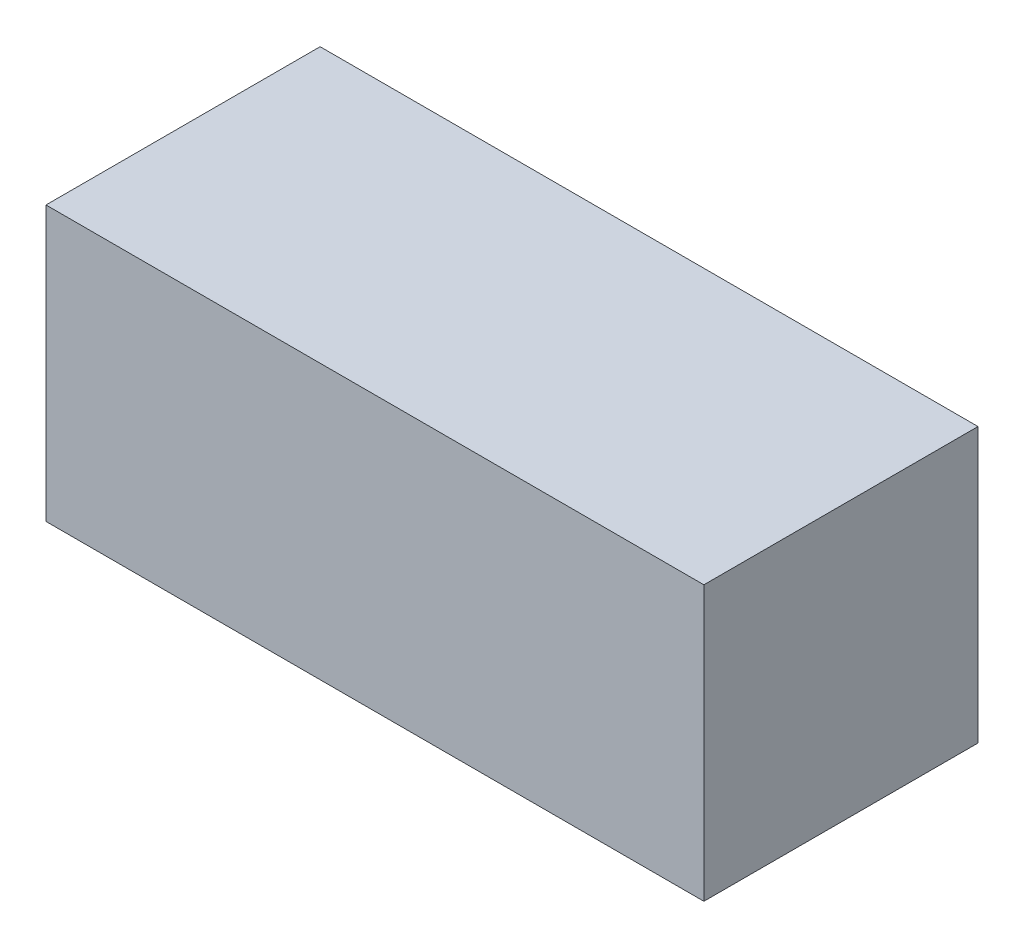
ISO-10303-21;
HEADER;
FILE_DESCRIPTION(('STEP AP214'),'2;1');
FILE_NAME('part.step','',(''),(''),'','','');
FILE_SCHEMA(('AUTOMOTIVE_DESIGN { 1 0 10303 214 1 1 1 1 }'));
ENDSEC;
DATA;
#1=APPLICATION_CONTEXT('core data for automotive mechanical design processes');
#2=APPLICATION_PROTOCOL_DEFINITION('international standard','automotive_design',2000,#1);
#3=PRODUCT_CONTEXT('',#1,'mechanical');
#4=PRODUCT('Part','Part','',(#3));
#5=PRODUCT_RELATED_PRODUCT_CATEGORY('part','',(#4));
#6=PRODUCT_DEFINITION_FORMATION('','',#4);
#7=PRODUCT_DEFINITION_CONTEXT('part definition',#1,'design');
#8=PRODUCT_DEFINITION('design','',#6,#7);
#9=PRODUCT_DEFINITION_SHAPE('','',#8);
#10=(LENGTH_UNIT() NAMED_UNIT(*) SI_UNIT(.MILLI.,.METRE.));
#11=(NAMED_UNIT(*) PLANE_ANGLE_UNIT() SI_UNIT($,.RADIAN.));
#12=(NAMED_UNIT(*) SI_UNIT($,.STERADIAN.) SOLID_ANGLE_UNIT());
#13=UNCERTAINTY_MEASURE_WITH_UNIT(LENGTH_MEASURE(1.E-05),#10,'distance_accuracy_value','');
#14=(GEOMETRIC_REPRESENTATION_CONTEXT(3) GLOBAL_UNCERTAINTY_ASSIGNED_CONTEXT((#13)) GLOBAL_UNIT_ASSIGNED_CONTEXT((#10,
#11,#12)) REPRESENTATION_CONTEXT('',''));
#15=CARTESIAN_POINT('',(0.,0.,0.));
#16=DIRECTION('',(0.,0.,1.));
#17=DIRECTION('',(1.,0.,0.));
#18=AXIS2_PLACEMENT_3D('',#15,#16,#17);
#19=CARTESIAN_POINT('',(-3.5047619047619,1.86190476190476,2.));
#20=DIRECTION('',(1.,0.,0.));
#21=DIRECTION('',(0.,1.,0.));
#22=AXIS2_PLACEMENT_3D('',#19,#20,#21);
#23=PLANE('',#22);
#24=DIRECTION('',(0.,-1.,0.));
#25=VECTOR('',#24,1.);
#26=CARTESIAN_POINT('',(-3.5047619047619,1.86190476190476,0.));
#27=LINE('',#26,#25);
#28=CARTESIAN_POINT('',(-3.5047619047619,1.86190476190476,0.));
#29=VERTEX_POINT('',#28);
#30=CARTESIAN_POINT('',(-3.5047619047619,-0.138095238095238,0.));
#31=VERTEX_POINT('',#30);
#32=EDGE_CURVE('E97',#29,#31,#27,.T.);
#33=ORIENTED_EDGE('',*,*,#32,.T.);
#34=DIRECTION('',(0.,0.,-1.));
#35=VECTOR('',#34,1.);
#36=CARTESIAN_POINT('',(-3.5047619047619,-0.138095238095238,2.));
#37=LINE('',#36,#35);
#38=CARTESIAN_POINT('',(-3.5047619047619,-0.138095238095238,2.));
#39=VERTEX_POINT('',#38);
#40=EDGE_CURVE('E11',#39,#31,#37,.T.);
#41=ORIENTED_EDGE('',*,*,#40,.F.);
#42=DIRECTION('',(0.,-1.,0.));
#43=VECTOR('',#42,1.);
#44=CARTESIAN_POINT('',(-3.5047619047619,1.86190476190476,2.));
#45=LINE('',#44,#43);
#46=CARTESIAN_POINT('',(-3.5047619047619,1.86190476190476,2.));
#47=VERTEX_POINT('',#46);
#48=EDGE_CURVE('E85',#47,#39,#45,.T.);
#49=ORIENTED_EDGE('',*,*,#48,.F.);
#50=DIRECTION('',(0.,0.,-1.));
#51=VECTOR('',#50,1.);
#52=CARTESIAN_POINT('',(-3.5047619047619,1.86190476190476,2.));
#53=LINE('',#52,#51);
#54=EDGE_CURVE('E93',#47,#29,#53,.T.);
#55=ORIENTED_EDGE('',*,*,#54,.T.);
#56=EDGE_LOOP('',(#33,#41,#49,#55));
#57=FACE_BOUND('',#56,.T.);
#58=ADVANCED_FACE('F34',(#57),#23,.F.);
#59=CARTESIAN_POINT('',(-3.5047619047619,-0.138095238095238,2.));
#60=DIRECTION('',(0.,1.,0.));
#61=DIRECTION('',(0.,0.,1.));
#62=AXIS2_PLACEMENT_3D('',#59,#60,#61);
#63=PLANE('',#62);
#64=DIRECTION('',(1.,0.,0.));
#65=VECTOR('',#64,1.);
#66=CARTESIAN_POINT('',(-3.5047619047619,-0.138095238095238,0.));
#67=LINE('',#66,#65);
#68=CARTESIAN_POINT('',(1.29523809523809,-0.138095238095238,0.));
#69=VERTEX_POINT('',#68);
#70=EDGE_CURVE('E89',#31,#69,#67,.T.);
#71=ORIENTED_EDGE('',*,*,#70,.T.);
#72=DIRECTION('',(0.,0.,-1.));
#73=VECTOR('',#72,1.);
#74=CARTESIAN_POINT('',(1.29523809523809,-0.138095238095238,2.));
#75=LINE('',#74,#73);
#76=CARTESIAN_POINT('',(1.29523809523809,-0.138095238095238,2.));
#77=VERTEX_POINT('',#76);
#78=EDGE_CURVE('E42',#77,#69,#75,.T.);
#79=ORIENTED_EDGE('',*,*,#78,.F.);
#80=DIRECTION('',(1.,0.,0.));
#81=VECTOR('',#80,1.);
#82=CARTESIAN_POINT('',(-3.5047619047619,-0.138095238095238,2.));
#83=LINE('',#82,#81);
#84=EDGE_CURVE('E80',#39,#77,#83,.T.);
#85=ORIENTED_EDGE('',*,*,#84,.F.);
#86=ORIENTED_EDGE('',*,*,#40,.T.);
#87=EDGE_LOOP('',(#71,#79,#85,#86));
#88=FACE_BOUND('',#87,.T.);
#89=ADVANCED_FACE('F88',(#88),#63,.F.);
#90=CARTESIAN_POINT('',(1.29523809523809,1.86190476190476,2.));
#91=DIRECTION('',(-1.,0.,0.));
#92=DIRECTION('',(0.,-1.,0.));
#93=AXIS2_PLACEMENT_3D('',#90,#91,#92);
#94=PLANE('',#93);
#95=DIRECTION('',(0.,1.,0.));
#96=VECTOR('',#95,1.);
#97=CARTESIAN_POINT('',(1.29523809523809,1.86190476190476,0.));
#98=LINE('',#97,#96);
#99=CARTESIAN_POINT('',(1.29523809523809,1.86190476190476,0.));
#100=VERTEX_POINT('',#99);
#101=EDGE_CURVE('E67',#69,#100,#98,.T.);
#102=ORIENTED_EDGE('',*,*,#101,.T.);
#103=DIRECTION('',(0.,0.,-1.));
#104=VECTOR('',#103,1.);
#105=CARTESIAN_POINT('',(1.29523809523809,1.86190476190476,2.));
#106=LINE('',#105,#104);
#107=CARTESIAN_POINT('',(1.29523809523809,1.86190476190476,2.));
#108=VERTEX_POINT('',#107);
#109=EDGE_CURVE('E90',#108,#100,#106,.T.);
#110=ORIENTED_EDGE('',*,*,#109,.F.);
#111=DIRECTION('',(0.,1.,0.));
#112=VECTOR('',#111,1.);
#113=CARTESIAN_POINT('',(1.29523809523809,1.86190476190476,2.));
#114=LINE('',#113,#112);
#115=EDGE_CURVE('E83',#77,#108,#114,.T.);
#116=ORIENTED_EDGE('',*,*,#115,.F.);
#117=ORIENTED_EDGE('',*,*,#78,.T.);
#118=EDGE_LOOP('',(#102,#110,#116,#117));
#119=FACE_BOUND('',#118,.T.);
#120=ADVANCED_FACE('F91',(#119),#94,.F.);
#121=CARTESIAN_POINT('',(-3.5047619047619,1.86190476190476,2.));
#122=DIRECTION('',(0.,-1.,0.));
#123=DIRECTION('',(0.,0.,-1.));
#124=AXIS2_PLACEMENT_3D('',#121,#122,#123);
#125=PLANE('',#124);
#126=DIRECTION('',(-1.,0.,0.));
#127=VECTOR('',#126,1.);
#128=CARTESIAN_POINT('',(-3.5047619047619,1.86190476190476,0.));
#129=LINE('',#128,#127);
#130=EDGE_CURVE('E73',#100,#29,#129,.T.);
#131=ORIENTED_EDGE('',*,*,#130,.T.);
#132=ORIENTED_EDGE('',*,*,#54,.F.);
#133=DIRECTION('',(-1.,0.,0.));
#134=VECTOR('',#133,1.);
#135=CARTESIAN_POINT('',(-3.5047619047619,1.86190476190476,2.));
#136=LINE('',#135,#134);
#137=EDGE_CURVE('E50',#108,#47,#136,.T.);
#138=ORIENTED_EDGE('',*,*,#137,.F.);
#139=ORIENTED_EDGE('',*,*,#109,.T.);
#140=EDGE_LOOP('',(#131,#132,#138,#139));
#141=FACE_BOUND('',#140,.T.);
#142=ADVANCED_FACE('F104',(#141),#125,.F.);
#143=CARTESIAN_POINT('',(0.,0.,2.));
#144=DIRECTION('',(0.,0.,1.));
#145=DIRECTION('',(1.,0.,0.));
#146=AXIS2_PLACEMENT_3D('',#143,#144,#145);
#147=PLANE('',#146);
#148=ORIENTED_EDGE('',*,*,#48,.T.);
#149=ORIENTED_EDGE('',*,*,#84,.T.);
#150=ORIENTED_EDGE('',*,*,#115,.T.);
#151=ORIENTED_EDGE('',*,*,#137,.T.);
#152=EDGE_LOOP('',(#148,#149,#150,#151));
#153=FACE_BOUND('',#152,.T.);
#154=ADVANCED_FACE('F81',(#153),#147,.T.);
#155=CARTESIAN_POINT('',(0.,0.,0.));
#156=DIRECTION('',(0.,0.,1.));
#157=DIRECTION('',(1.,0.,0.));
#158=AXIS2_PLACEMENT_3D('',#155,#156,#157);
#159=PLANE('',#158);
#160=ORIENTED_EDGE('',*,*,#32,.F.);
#161=ORIENTED_EDGE('',*,*,#130,.F.);
#162=ORIENTED_EDGE('',*,*,#101,.F.);
#163=ORIENTED_EDGE('',*,*,#70,.F.);
#164=EDGE_LOOP('',(#160,#161,#162,#163));
#165=FACE_BOUND('',#164,.T.);
#166=ADVANCED_FACE('F107',(#165),#159,.F.);
#167=CLOSED_SHELL('',(#58,#89,#120,#142,#154,#166));
#168=MANIFOLD_SOLID_BREP('B2',#167);
#169=ADVANCED_BREP_SHAPE_REPRESENTATION('',(#18,#168),#14);
#170=SHAPE_DEFINITION_REPRESENTATION(#9,#169);
ENDSEC;
END-ISO-10303-21;
